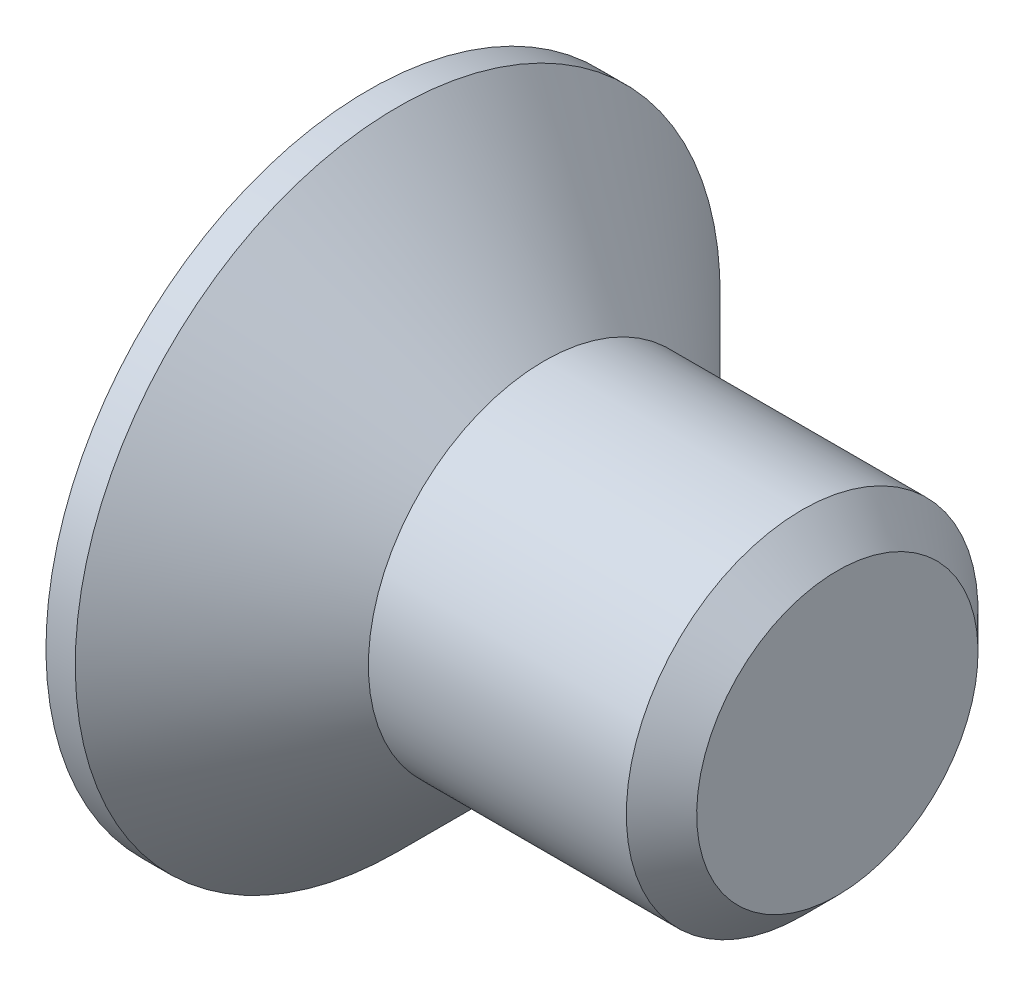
ISO-10303-21;
HEADER;
FILE_DESCRIPTION(('STEP AP214'),'2;1');
FILE_NAME('part.step','',(''),(''),'','','');
FILE_SCHEMA(('AUTOMOTIVE_DESIGN { 1 0 10303 214 1 1 1 1 }'));
ENDSEC;
DATA;
#1=APPLICATION_CONTEXT('core data for automotive mechanical design processes');
#2=APPLICATION_PROTOCOL_DEFINITION('international standard','automotive_design',2000,#1);
#3=PRODUCT_CONTEXT('',#1,'mechanical');
#4=PRODUCT('Part','Part','',(#3));
#5=PRODUCT_RELATED_PRODUCT_CATEGORY('part','',(#4));
#6=PRODUCT_DEFINITION_FORMATION('','',#4);
#7=PRODUCT_DEFINITION_CONTEXT('part definition',#1,'design');
#8=PRODUCT_DEFINITION('design','',#6,#7);
#9=PRODUCT_DEFINITION_SHAPE('','',#8);
#10=(LENGTH_UNIT() NAMED_UNIT(*) SI_UNIT(.MILLI.,.METRE.));
#11=(NAMED_UNIT(*) PLANE_ANGLE_UNIT() SI_UNIT($,.RADIAN.));
#12=(NAMED_UNIT(*) SI_UNIT($,.STERADIAN.) SOLID_ANGLE_UNIT());
#13=UNCERTAINTY_MEASURE_WITH_UNIT(LENGTH_MEASURE(1.E-05),#10,'distance_accuracy_value','');
#14=(GEOMETRIC_REPRESENTATION_CONTEXT(3) GLOBAL_UNCERTAINTY_ASSIGNED_CONTEXT((#13)) GLOBAL_UNIT_ASSIGNED_CONTEXT((#10,
#11,#12)) REPRESENTATION_CONTEXT('',''));
#15=CARTESIAN_POINT('',(0.,0.,0.));
#16=DIRECTION('',(0.,0.,1.));
#17=DIRECTION('',(1.,0.,0.));
#18=AXIS2_PLACEMENT_3D('',#15,#16,#17);
#19=CARTESIAN_POINT('',(0.,0.,0.));
#20=DIRECTION('',(-1.,0.,0.));
#21=DIRECTION('',(0.,-1.,0.));
#22=AXIS2_PLACEMENT_3D('',#19,#20,#21);
#23=CONICAL_SURFACE('',#22,3.,0.78539816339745);
#24=CARTESIAN_POINT('',(-2.49999999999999,0.,0.));
#25=DIRECTION('',(-1.,0.,0.));
#26=DIRECTION('',(0.,-1.,0.));
#27=AXIS2_PLACEMENT_3D('',#24,#25,#26);
#28=CIRCLE('',#27,5.5);
#29=CARTESIAN_POINT('',(-2.49999999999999,-5.5,0.));
#30=VERTEX_POINT('',#29);
#31=EDGE_CURVE('E188',#30,#30,#28,.T.);
#32=ORIENTED_EDGE('',*,*,#31,.F.);
#33=EDGE_LOOP('',(#32));
#34=FACE_BOUND('',#33,.T.);
#35=CARTESIAN_POINT('',(0.,0.,0.));
#36=DIRECTION('',(-1.,0.,0.));
#37=DIRECTION('',(0.,-1.,0.));
#38=AXIS2_PLACEMENT_3D('',#35,#36,#37);
#39=CIRCLE('',#38,3.);
#40=CARTESIAN_POINT('',(0.,-3.,0.));
#41=VERTEX_POINT('',#40);
#42=EDGE_CURVE('E211',#41,#41,#39,.T.);
#43=ORIENTED_EDGE('',*,*,#42,.T.);
#44=EDGE_LOOP('',(#43));
#45=FACE_BOUND('',#44,.T.);
#46=ADVANCED_FACE('F32',(#34,#45),#23,.T.);
#47=CARTESIAN_POINT('',(-3.,0.,0.));
#48=DIRECTION('',(-1.,0.,0.));
#49=DIRECTION('',(0.,-1.,0.));
#50=AXIS2_PLACEMENT_3D('',#47,#48,#49);
#51=CYLINDRICAL_SURFACE('',#50,3.);
#52=CARTESIAN_POINT('',(4.4,0.,0.));
#53=DIRECTION('',(-1.,0.,0.));
#54=DIRECTION('',(0.,-1.,0.));
#55=AXIS2_PLACEMENT_3D('',#52,#53,#54);
#56=CIRCLE('',#55,3.);
#57=CARTESIAN_POINT('',(4.4,-3.,0.));
#58=VERTEX_POINT('',#57);
#59=EDGE_CURVE('E40',#58,#58,#56,.T.);
#60=ORIENTED_EDGE('',*,*,#59,.T.);
#61=EDGE_LOOP('',(#60));
#62=FACE_BOUND('',#61,.T.);
#63=ORIENTED_EDGE('',*,*,#42,.F.);
#64=EDGE_LOOP('',(#63));
#65=FACE_BOUND('',#64,.T.);
#66=ADVANCED_FACE('F216',(#62,#65),#51,.T.);
#67=CARTESIAN_POINT('',(5.,0.,0.));
#68=DIRECTION('',(-1.,0.,0.));
#69=DIRECTION('',(0.,-1.,0.));
#70=AXIS2_PLACEMENT_3D('',#67,#68,#69);
#71=PLANE('',#70);
#72=CARTESIAN_POINT('',(5.,0.,0.));
#73=DIRECTION('',(-1.,0.,0.));
#74=DIRECTION('',(0.,-1.,0.));
#75=AXIS2_PLACEMENT_3D('',#72,#73,#74);
#76=CIRCLE('',#75,2.4);
#77=CARTESIAN_POINT('',(5.,-2.4,0.));
#78=VERTEX_POINT('',#77);
#79=EDGE_CURVE('E11',#78,#78,#76,.F.);
#80=ORIENTED_EDGE('',*,*,#79,.T.);
#81=EDGE_LOOP('',(#80));
#82=FACE_BOUND('',#81,.T.);
#83=ADVANCED_FACE('F238',(#82),#71,.F.);
#84=CARTESIAN_POINT('',(-3.,5.5,0.));
#85=DIRECTION('',(1.,0.,0.));
#86=DIRECTION('',(0.,1.,0.));
#87=AXIS2_PLACEMENT_3D('',#84,#85,#86);
#88=PLANE('',#87);
#89=DIRECTION('',(0.,0.,-1.));
#90=VECTOR('',#89,1.);
#91=CARTESIAN_POINT('',(-3.,0.825,-3.3));
#92=LINE('',#91,#90);
#93=CARTESIAN_POINT('',(-3.,0.825,-0.825));
#94=VERTEX_POINT('',#93);
#95=CARTESIAN_POINT('',(-3.,0.825,-3.3));
#96=VERTEX_POINT('',#95);
#97=EDGE_CURVE('E157',#94,#96,#92,.T.);
#98=ORIENTED_EDGE('',*,*,#97,.F.);
#99=DIRECTION('',(0.,-1.,0.));
#100=VECTOR('',#99,1.);
#101=CARTESIAN_POINT('',(-3.,0.825,-0.825));
#102=LINE('',#101,#100);
#103=CARTESIAN_POINT('',(-3.,3.3,-0.825));
#104=VERTEX_POINT('',#103);
#105=EDGE_CURVE('E47',#104,#94,#102,.T.);
#106=ORIENTED_EDGE('',*,*,#105,.F.);
#107=DIRECTION('',(0.,0.,-1.));
#108=VECTOR('',#107,1.);
#109=CARTESIAN_POINT('',(-3.,3.3,-0.825));
#110=LINE('',#109,#108);
#111=CARTESIAN_POINT('',(-3.,3.3,0.825));
#112=VERTEX_POINT('',#111);
#113=EDGE_CURVE('E184',#112,#104,#110,.T.);
#114=ORIENTED_EDGE('',*,*,#113,.F.);
#115=DIRECTION('',(0.,1.,0.));
#116=VECTOR('',#115,1.);
#117=CARTESIAN_POINT('',(-3.,3.3,0.825));
#118=LINE('',#117,#116);
#119=CARTESIAN_POINT('',(-3.,0.825,0.825));
#120=VERTEX_POINT('',#119);
#121=EDGE_CURVE('E182',#120,#112,#118,.T.);
#122=ORIENTED_EDGE('',*,*,#121,.F.);
#123=DIRECTION('',(0.,0.,-1.));
#124=VECTOR('',#123,1.);
#125=CARTESIAN_POINT('',(-3.,0.825,0.825));
#126=LINE('',#125,#124);
#127=CARTESIAN_POINT('',(-3.,0.825,3.3));
#128=VERTEX_POINT('',#127);
#129=EDGE_CURVE('E131',#128,#120,#126,.T.);
#130=ORIENTED_EDGE('',*,*,#129,.F.);
#131=DIRECTION('',(0.,1.,0.));
#132=VECTOR('',#131,1.);
#133=CARTESIAN_POINT('',(-3.,0.825,3.3));
#134=LINE('',#133,#132);
#135=CARTESIAN_POINT('',(-3.,-0.825,3.3));
#136=VERTEX_POINT('',#135);
#137=EDGE_CURVE('E178',#136,#128,#134,.T.);
#138=ORIENTED_EDGE('',*,*,#137,.F.);
#139=DIRECTION('',(0.,0.,1.));
#140=VECTOR('',#139,1.);
#141=CARTESIAN_POINT('',(-3.,-0.825,3.3));
#142=LINE('',#141,#140);
#143=CARTESIAN_POINT('',(-3.,-0.825,0.825));
#144=VERTEX_POINT('',#143);
#145=EDGE_CURVE('E175',#144,#136,#142,.T.);
#146=ORIENTED_EDGE('',*,*,#145,.F.);
#147=DIRECTION('',(0.,1.,0.));
#148=VECTOR('',#147,1.);
#149=CARTESIAN_POINT('',(-3.,-0.825,0.825));
#150=LINE('',#149,#148);
#151=CARTESIAN_POINT('',(-3.,-3.3,0.825));
#152=VERTEX_POINT('',#151);
#153=EDGE_CURVE('E172',#152,#144,#150,.T.);
#154=ORIENTED_EDGE('',*,*,#153,.F.);
#155=DIRECTION('',(0.,0.,1.));
#156=VECTOR('',#155,1.);
#157=CARTESIAN_POINT('',(-3.,-3.3,0.825));
#158=LINE('',#157,#156);
#159=CARTESIAN_POINT('',(-3.,-3.3,-0.825));
#160=VERTEX_POINT('',#159);
#161=EDGE_CURVE('E169',#160,#152,#158,.T.);
#162=ORIENTED_EDGE('',*,*,#161,.F.);
#163=DIRECTION('',(0.,-1.,0.));
#164=VECTOR('',#163,1.);
#165=CARTESIAN_POINT('',(-3.,-3.3,-0.825));
#166=LINE('',#165,#164);
#167=CARTESIAN_POINT('',(-3.,-0.825,-0.825));
#168=VERTEX_POINT('',#167);
#169=EDGE_CURVE('E166',#168,#160,#166,.T.);
#170=ORIENTED_EDGE('',*,*,#169,.F.);
#171=DIRECTION('',(0.,0.,1.));
#172=VECTOR('',#171,1.);
#173=CARTESIAN_POINT('',(-3.,-0.825,-0.825));
#174=LINE('',#173,#172);
#175=CARTESIAN_POINT('',(-3.,-0.825,-3.3));
#176=VERTEX_POINT('',#175);
#177=EDGE_CURVE('E163',#176,#168,#174,.T.);
#178=ORIENTED_EDGE('',*,*,#177,.F.);
#179=DIRECTION('',(0.,-1.,0.));
#180=VECTOR('',#179,1.);
#181=CARTESIAN_POINT('',(-3.,-0.825,-3.3));
#182=LINE('',#181,#180);
#183=EDGE_CURVE('E160',#96,#176,#182,.T.);
#184=ORIENTED_EDGE('',*,*,#183,.F.);
#185=EDGE_LOOP('',(#98,#106,#114,#122,#130,#138,#146,#154,#162,#170,#178,#184));
#186=FACE_BOUND('',#185,.T.);
#187=CARTESIAN_POINT('',(-3.,0.,0.));
#188=DIRECTION('',(-1.,0.,0.));
#189=DIRECTION('',(0.,-1.,0.));
#190=AXIS2_PLACEMENT_3D('',#187,#188,#189);
#191=CIRCLE('',#190,5.5);
#192=CARTESIAN_POINT('',(-3.,-5.5,0.));
#193=VERTEX_POINT('',#192);
#194=EDGE_CURVE('E208',#193,#193,#191,.T.);
#195=ORIENTED_EDGE('',*,*,#194,.T.);
#196=EDGE_LOOP('',(#195));
#197=FACE_BOUND('',#196,.T.);
#198=ADVANCED_FACE('F229',(#186,#197),#88,.F.);
#199=CARTESIAN_POINT('',(-3.,0.,0.));
#200=DIRECTION('',(-1.,0.,0.));
#201=DIRECTION('',(0.,-1.,0.));
#202=AXIS2_PLACEMENT_3D('',#199,#200,#201);
#203=CYLINDRICAL_SURFACE('',#202,5.5);
#204=ORIENTED_EDGE('',*,*,#194,.F.);
#205=EDGE_LOOP('',(#204));
#206=FACE_BOUND('',#205,.T.);
#207=ORIENTED_EDGE('',*,*,#31,.T.);
#208=EDGE_LOOP('',(#207));
#209=FACE_BOUND('',#208,.T.);
#210=ADVANCED_FACE('F221',(#206,#209),#203,.T.);
#211=CARTESIAN_POINT('',(4.4,0.,0.));
#212=DIRECTION('',(-1.,0.,0.));
#213=DIRECTION('',(0.,-1.,0.));
#214=AXIS2_PLACEMENT_3D('',#211,#212,#213);
#215=CONICAL_SURFACE('',#214,3.,0.785398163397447);
#216=ORIENTED_EDGE('',*,*,#79,.F.);
#217=EDGE_LOOP('',(#216));
#218=FACE_BOUND('',#217,.T.);
#219=ORIENTED_EDGE('',*,*,#59,.F.);
#220=EDGE_LOOP('',(#219));
#221=FACE_BOUND('',#220,.T.);
#222=ADVANCED_FACE('F34',(#218,#221),#215,.T.);
#223=CARTESIAN_POINT('',(-0.5,0.825,-0.825));
#224=DIRECTION('',(0.,0.,-1.));
#225=DIRECTION('',(-1.,0.,0.));
#226=AXIS2_PLACEMENT_3D('',#223,#224,#225);
#227=PLANE('',#226);
#228=ORIENTED_EDGE('',*,*,#105,.T.);
#229=DIRECTION('',(-1.,0.,0.));
#230=VECTOR('',#229,1.);
#231=CARTESIAN_POINT('',(-0.5,0.825,-0.825));
#232=LINE('',#231,#230);
#233=CARTESIAN_POINT('',(-0.5,0.825,-0.825));
#234=VERTEX_POINT('',#233);
#235=EDGE_CURVE('E95',#234,#94,#232,.T.);
#236=ORIENTED_EDGE('',*,*,#235,.F.);
#237=DIRECTION('',(0.,-1.,0.));
#238=VECTOR('',#237,1.);
#239=CARTESIAN_POINT('',(-0.5,0.825,-0.825));
#240=LINE('',#239,#238);
#241=CARTESIAN_POINT('',(-0.5,3.3,-0.825));
#242=VERTEX_POINT('',#241);
#243=EDGE_CURVE('E186',#242,#234,#240,.T.);
#244=ORIENTED_EDGE('',*,*,#243,.F.);
#245=DIRECTION('',(-1.,0.,0.));
#246=VECTOR('',#245,1.);
#247=CARTESIAN_POINT('',(-0.5,3.3,-0.825));
#248=LINE('',#247,#246);
#249=EDGE_CURVE('E55',#242,#104,#248,.T.);
#250=ORIENTED_EDGE('',*,*,#249,.T.);
#251=EDGE_LOOP('',(#228,#236,#244,#250));
#252=FACE_BOUND('',#251,.T.);
#253=ADVANCED_FACE('F220',(#252),#227,.F.);
#254=CARTESIAN_POINT('',(-0.5,3.3,-0.825));
#255=DIRECTION('',(0.,1.,0.));
#256=DIRECTION('',(-1.,0.,0.));
#257=AXIS2_PLACEMENT_3D('',#254,#255,#256);
#258=PLANE('',#257);
#259=ORIENTED_EDGE('',*,*,#113,.T.);
#260=ORIENTED_EDGE('',*,*,#249,.F.);
#261=DIRECTION('',(0.,0.,-1.));
#262=VECTOR('',#261,1.);
#263=CARTESIAN_POINT('',(-0.5,3.3,-0.825));
#264=LINE('',#263,#262);
#265=CARTESIAN_POINT('',(-0.5,3.3,0.825));
#266=VERTEX_POINT('',#265);
#267=EDGE_CURVE('E143',#266,#242,#264,.T.);
#268=ORIENTED_EDGE('',*,*,#267,.F.);
#269=DIRECTION('',(-1.,0.,0.));
#270=VECTOR('',#269,1.);
#271=CARTESIAN_POINT('',(-0.5,3.3,0.825));
#272=LINE('',#271,#270);
#273=EDGE_CURVE('E135',#266,#112,#272,.T.);
#274=ORIENTED_EDGE('',*,*,#273,.T.);
#275=EDGE_LOOP('',(#259,#260,#268,#274));
#276=FACE_BOUND('',#275,.T.);
#277=ADVANCED_FACE('F227',(#276),#258,.F.);
#278=CARTESIAN_POINT('',(-0.5,3.3,0.825));
#279=DIRECTION('',(0.,0.,1.));
#280=DIRECTION('',(1.,0.,0.));
#281=AXIS2_PLACEMENT_3D('',#278,#279,#280);
#282=PLANE('',#281);
#283=ORIENTED_EDGE('',*,*,#121,.T.);
#284=ORIENTED_EDGE('',*,*,#273,.F.);
#285=DIRECTION('',(0.,1.,0.));
#286=VECTOR('',#285,1.);
#287=CARTESIAN_POINT('',(-0.5,3.3,0.825));
#288=LINE('',#287,#286);
#289=CARTESIAN_POINT('',(-0.5,0.825,0.825));
#290=VERTEX_POINT('',#289);
#291=EDGE_CURVE('E139',#290,#266,#288,.T.);
#292=ORIENTED_EDGE('',*,*,#291,.F.);
#293=DIRECTION('',(-1.,0.,0.));
#294=VECTOR('',#293,1.);
#295=CARTESIAN_POINT('',(-0.5,0.825,0.825));
#296=LINE('',#295,#294);
#297=EDGE_CURVE('E124',#290,#120,#296,.T.);
#298=ORIENTED_EDGE('',*,*,#297,.T.);
#299=EDGE_LOOP('',(#283,#284,#292,#298));
#300=FACE_BOUND('',#299,.T.);
#301=ADVANCED_FACE('F140',(#300),#282,.F.);
#302=CARTESIAN_POINT('',(-0.5,0.825,0.825));
#303=DIRECTION('',(0.,1.,0.));
#304=DIRECTION('',(-1.,0.,0.));
#305=AXIS2_PLACEMENT_3D('',#302,#303,#304);
#306=PLANE('',#305);
#307=ORIENTED_EDGE('',*,*,#129,.T.);
#308=ORIENTED_EDGE('',*,*,#297,.F.);
#309=DIRECTION('',(0.,0.,-1.));
#310=VECTOR('',#309,1.);
#311=CARTESIAN_POINT('',(-0.5,0.825,0.825));
#312=LINE('',#311,#310);
#313=CARTESIAN_POINT('',(-0.5,0.825,3.3));
#314=VERTEX_POINT('',#313);
#315=EDGE_CURVE('E128',#314,#290,#312,.T.);
#316=ORIENTED_EDGE('',*,*,#315,.F.);
#317=DIRECTION('',(-1.,0.,0.));
#318=VECTOR('',#317,1.);
#319=CARTESIAN_POINT('',(-0.5,0.825,3.3));
#320=LINE('',#319,#318);
#321=EDGE_CURVE('E136',#314,#128,#320,.T.);
#322=ORIENTED_EDGE('',*,*,#321,.T.);
#323=EDGE_LOOP('',(#307,#308,#316,#322));
#324=FACE_BOUND('',#323,.T.);
#325=ADVANCED_FACE('F126',(#324),#306,.F.);
#326=CARTESIAN_POINT('',(-0.5,0.825,3.3));
#327=DIRECTION('',(0.,0.,1.));
#328=DIRECTION('',(1.,0.,0.));
#329=AXIS2_PLACEMENT_3D('',#326,#327,#328);
#330=PLANE('',#329);
#331=ORIENTED_EDGE('',*,*,#137,.T.);
#332=ORIENTED_EDGE('',*,*,#321,.F.);
#333=DIRECTION('',(0.,1.,0.));
#334=VECTOR('',#333,1.);
#335=CARTESIAN_POINT('',(-0.5,0.825,3.3));
#336=LINE('',#335,#334);
#337=CARTESIAN_POINT('',(-0.5,-0.825,3.3));
#338=VERTEX_POINT('',#337);
#339=EDGE_CURVE('E149',#338,#314,#336,.T.);
#340=ORIENTED_EDGE('',*,*,#339,.F.);
#341=DIRECTION('',(-1.,0.,0.));
#342=VECTOR('',#341,1.);
#343=CARTESIAN_POINT('',(-0.5,-0.825,3.3));
#344=LINE('',#343,#342);
#345=EDGE_CURVE('E191',#338,#136,#344,.T.);
#346=ORIENTED_EDGE('',*,*,#345,.T.);
#347=EDGE_LOOP('',(#331,#332,#340,#346));
#348=FACE_BOUND('',#347,.T.);
#349=ADVANCED_FACE('F276',(#348),#330,.F.);
#350=CARTESIAN_POINT('',(-0.5,-0.825,3.3));
#351=DIRECTION('',(0.,-1.,0.));
#352=DIRECTION('',(1.,0.,0.));
#353=AXIS2_PLACEMENT_3D('',#350,#351,#352);
#354=PLANE('',#353);
#355=ORIENTED_EDGE('',*,*,#145,.T.);
#356=ORIENTED_EDGE('',*,*,#345,.F.);
#357=DIRECTION('',(0.,0.,1.));
#358=VECTOR('',#357,1.);
#359=CARTESIAN_POINT('',(-0.5,-0.825,3.3));
#360=LINE('',#359,#358);
#361=CARTESIAN_POINT('',(-0.5,-0.825,0.825));
#362=VERTEX_POINT('',#361);
#363=EDGE_CURVE('E151',#362,#338,#360,.T.);
#364=ORIENTED_EDGE('',*,*,#363,.F.);
#365=DIRECTION('',(-1.,0.,0.));
#366=VECTOR('',#365,1.);
#367=CARTESIAN_POINT('',(-0.5,-0.825,0.825));
#368=LINE('',#367,#366);
#369=EDGE_CURVE('E193',#362,#144,#368,.T.);
#370=ORIENTED_EDGE('',*,*,#369,.T.);
#371=EDGE_LOOP('',(#355,#356,#364,#370));
#372=FACE_BOUND('',#371,.T.);
#373=ADVANCED_FACE('F272',(#372),#354,.F.);
#374=CARTESIAN_POINT('',(-0.5,-0.825,0.825));
#375=DIRECTION('',(0.,0.,1.));
#376=DIRECTION('',(1.,0.,0.));
#377=AXIS2_PLACEMENT_3D('',#374,#375,#376);
#378=PLANE('',#377);
#379=ORIENTED_EDGE('',*,*,#153,.T.);
#380=ORIENTED_EDGE('',*,*,#369,.F.);
#381=DIRECTION('',(0.,1.,0.));
#382=VECTOR('',#381,1.);
#383=CARTESIAN_POINT('',(-0.5,-0.825,0.825));
#384=LINE('',#383,#382);
#385=CARTESIAN_POINT('',(-0.5,-3.3,0.825));
#386=VERTEX_POINT('',#385);
#387=EDGE_CURVE('E421',#386,#362,#384,.T.);
#388=ORIENTED_EDGE('',*,*,#387,.F.);
#389=DIRECTION('',(-1.,0.,0.));
#390=VECTOR('',#389,1.);
#391=CARTESIAN_POINT('',(-0.5,-3.3,0.825));
#392=LINE('',#391,#390);
#393=EDGE_CURVE('E195',#386,#152,#392,.T.);
#394=ORIENTED_EDGE('',*,*,#393,.T.);
#395=EDGE_LOOP('',(#379,#380,#388,#394));
#396=FACE_BOUND('',#395,.T.);
#397=ADVANCED_FACE('F268',(#396),#378,.F.);
#398=CARTESIAN_POINT('',(-0.5,-3.3,0.825));
#399=DIRECTION('',(0.,-1.,0.));
#400=DIRECTION('',(1.,0.,0.));
#401=AXIS2_PLACEMENT_3D('',#398,#399,#400);
#402=PLANE('',#401);
#403=ORIENTED_EDGE('',*,*,#161,.T.);
#404=ORIENTED_EDGE('',*,*,#393,.F.);
#405=DIRECTION('',(0.,0.,1.));
#406=VECTOR('',#405,1.);
#407=CARTESIAN_POINT('',(-0.5,-3.3,0.825));
#408=LINE('',#407,#406);
#409=CARTESIAN_POINT('',(-0.5,-3.3,-0.825));
#410=VERTEX_POINT('',#409);
#411=EDGE_CURVE('E418',#410,#386,#408,.T.);
#412=ORIENTED_EDGE('',*,*,#411,.F.);
#413=DIRECTION('',(-1.,0.,0.));
#414=VECTOR('',#413,1.);
#415=CARTESIAN_POINT('',(-0.5,-3.3,-0.825));
#416=LINE('',#415,#414);
#417=EDGE_CURVE('E197',#410,#160,#416,.T.);
#418=ORIENTED_EDGE('',*,*,#417,.T.);
#419=EDGE_LOOP('',(#403,#404,#412,#418));
#420=FACE_BOUND('',#419,.T.);
#421=ADVANCED_FACE('F264',(#420),#402,.F.);
#422=CARTESIAN_POINT('',(-0.5,-3.3,-0.825));
#423=DIRECTION('',(0.,0.,-1.));
#424=DIRECTION('',(-1.,0.,0.));
#425=AXIS2_PLACEMENT_3D('',#422,#423,#424);
#426=PLANE('',#425);
#427=ORIENTED_EDGE('',*,*,#169,.T.);
#428=ORIENTED_EDGE('',*,*,#417,.F.);
#429=DIRECTION('',(0.,-1.,0.));
#430=VECTOR('',#429,1.);
#431=CARTESIAN_POINT('',(-0.5,-3.3,-0.825));
#432=LINE('',#431,#430);
#433=CARTESIAN_POINT('',(-0.5,-0.825,-0.825));
#434=VERTEX_POINT('',#433);
#435=EDGE_CURVE('E415',#434,#410,#432,.T.);
#436=ORIENTED_EDGE('',*,*,#435,.F.);
#437=DIRECTION('',(-1.,0.,0.));
#438=VECTOR('',#437,1.);
#439=CARTESIAN_POINT('',(-0.5,-0.825,-0.825));
#440=LINE('',#439,#438);
#441=EDGE_CURVE('E199',#434,#168,#440,.T.);
#442=ORIENTED_EDGE('',*,*,#441,.T.);
#443=EDGE_LOOP('',(#427,#428,#436,#442));
#444=FACE_BOUND('',#443,.T.);
#445=ADVANCED_FACE('F260',(#444),#426,.F.);
#446=CARTESIAN_POINT('',(-0.5,-0.825,-0.825));
#447=DIRECTION('',(0.,-1.,0.));
#448=DIRECTION('',(1.,0.,0.));
#449=AXIS2_PLACEMENT_3D('',#446,#447,#448);
#450=PLANE('',#449);
#451=ORIENTED_EDGE('',*,*,#177,.T.);
#452=ORIENTED_EDGE('',*,*,#441,.F.);
#453=DIRECTION('',(0.,0.,1.));
#454=VECTOR('',#453,1.);
#455=CARTESIAN_POINT('',(-0.5,-0.825,-0.825));
#456=LINE('',#455,#454);
#457=CARTESIAN_POINT('',(-0.5,-0.825,-3.3));
#458=VERTEX_POINT('',#457);
#459=EDGE_CURVE('E412',#458,#434,#456,.T.);
#460=ORIENTED_EDGE('',*,*,#459,.F.);
#461=DIRECTION('',(-1.,0.,0.));
#462=VECTOR('',#461,1.);
#463=CARTESIAN_POINT('',(-0.5,-0.825,-3.3));
#464=LINE('',#463,#462);
#465=EDGE_CURVE('E201',#458,#176,#464,.T.);
#466=ORIENTED_EDGE('',*,*,#465,.T.);
#467=EDGE_LOOP('',(#451,#452,#460,#466));
#468=FACE_BOUND('',#467,.T.);
#469=ADVANCED_FACE('F256',(#468),#450,.F.);
#470=CARTESIAN_POINT('',(-0.5,-0.825,-3.3));
#471=DIRECTION('',(0.,0.,-1.));
#472=DIRECTION('',(-1.,0.,0.));
#473=AXIS2_PLACEMENT_3D('',#470,#471,#472);
#474=PLANE('',#473);
#475=ORIENTED_EDGE('',*,*,#183,.T.);
#476=ORIENTED_EDGE('',*,*,#465,.F.);
#477=DIRECTION('',(0.,-1.,0.));
#478=VECTOR('',#477,1.);
#479=CARTESIAN_POINT('',(-0.5,-0.825,-3.3));
#480=LINE('',#479,#478);
#481=CARTESIAN_POINT('',(-0.5,0.825,-3.3));
#482=VERTEX_POINT('',#481);
#483=EDGE_CURVE('E407',#482,#458,#480,.T.);
#484=ORIENTED_EDGE('',*,*,#483,.F.);
#485=DIRECTION('',(-1.,0.,0.));
#486=VECTOR('',#485,1.);
#487=CARTESIAN_POINT('',(-0.5,0.825,-3.3));
#488=LINE('',#487,#486);
#489=EDGE_CURVE('E203',#482,#96,#488,.T.);
#490=ORIENTED_EDGE('',*,*,#489,.T.);
#491=EDGE_LOOP('',(#475,#476,#484,#490));
#492=FACE_BOUND('',#491,.T.);
#493=ADVANCED_FACE('F252',(#492),#474,.F.);
#494=CARTESIAN_POINT('',(-0.5,0.825,-3.3));
#495=DIRECTION('',(0.,1.,0.));
#496=DIRECTION('',(-1.,0.,0.));
#497=AXIS2_PLACEMENT_3D('',#494,#495,#496);
#498=PLANE('',#497);
#499=ORIENTED_EDGE('',*,*,#97,.T.);
#500=ORIENTED_EDGE('',*,*,#489,.F.);
#501=DIRECTION('',(0.,0.,-1.));
#502=VECTOR('',#501,1.);
#503=CARTESIAN_POINT('',(-0.5,0.825,-3.3));
#504=LINE('',#503,#502);
#505=EDGE_CURVE('E405',#234,#482,#504,.T.);
#506=ORIENTED_EDGE('',*,*,#505,.F.);
#507=ORIENTED_EDGE('',*,*,#235,.T.);
#508=EDGE_LOOP('',(#499,#500,#506,#507));
#509=FACE_BOUND('',#508,.T.);
#510=ADVANCED_FACE('F249',(#509),#498,.F.);
#511=CARTESIAN_POINT('',(-0.5,0.,0.));
#512=DIRECTION('',(1.,0.,0.));
#513=DIRECTION('',(0.,0.,-1.));
#514=AXIS2_PLACEMENT_3D('',#511,#512,#513);
#515=PLANE('',#514);
#516=ORIENTED_EDGE('',*,*,#243,.T.);
#517=ORIENTED_EDGE('',*,*,#505,.T.);
#518=ORIENTED_EDGE('',*,*,#483,.T.);
#519=ORIENTED_EDGE('',*,*,#459,.T.);
#520=ORIENTED_EDGE('',*,*,#435,.T.);
#521=ORIENTED_EDGE('',*,*,#411,.T.);
#522=ORIENTED_EDGE('',*,*,#387,.T.);
#523=ORIENTED_EDGE('',*,*,#363,.T.);
#524=ORIENTED_EDGE('',*,*,#339,.T.);
#525=ORIENTED_EDGE('',*,*,#315,.T.);
#526=ORIENTED_EDGE('',*,*,#291,.T.);
#527=ORIENTED_EDGE('',*,*,#267,.T.);
#528=EDGE_LOOP('',(#516,#517,#518,#519,#520,#521,#522,#523,#524,#525,#526,#527));
#529=FACE_BOUND('',#528,.T.);
#530=ADVANCED_FACE('F146',(#529),#515,.F.);
#531=CLOSED_SHELL('',(#46,#66,#83,#198,#210,#222,#253,#277,#301,#325,#349,#373,#397,#421,#445,
#469,#493,#510,#530));
#532=MANIFOLD_SOLID_BREP('B2',#531);
#533=ADVANCED_BREP_SHAPE_REPRESENTATION('',(#18,#532),#14);
#534=SHAPE_DEFINITION_REPRESENTATION(#9,#533);
ENDSEC;
END-ISO-10303-21;
